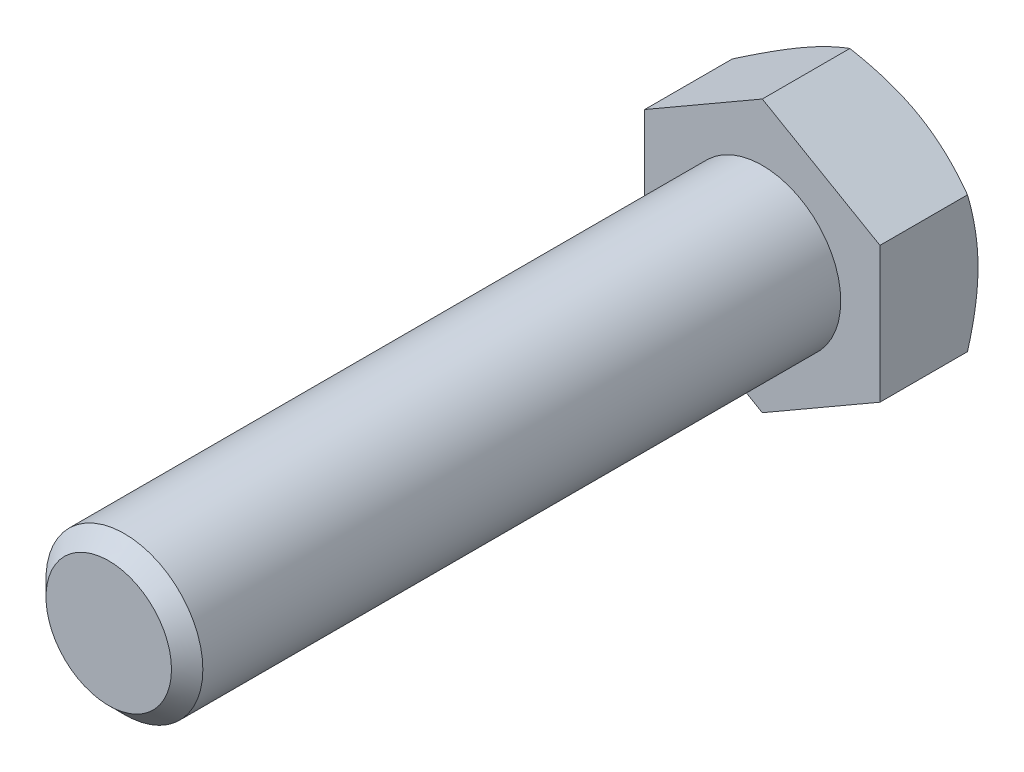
ISO-10303-21;
HEADER;
FILE_DESCRIPTION(('STEP AP214'),'2;1');
FILE_NAME('part.step','',(''),(''),'','','');
FILE_SCHEMA(('AUTOMOTIVE_DESIGN { 1 0 10303 214 1 1 1 1 }'));
ENDSEC;
DATA;
#1=APPLICATION_CONTEXT('core data for automotive mechanical design processes');
#2=APPLICATION_PROTOCOL_DEFINITION('international standard','automotive_design',2000,#1);
#3=PRODUCT_CONTEXT('',#1,'mechanical');
#4=PRODUCT('Part','Part','',(#3));
#5=PRODUCT_RELATED_PRODUCT_CATEGORY('part','',(#4));
#6=PRODUCT_DEFINITION_FORMATION('','',#4);
#7=PRODUCT_DEFINITION_CONTEXT('part definition',#1,'design');
#8=PRODUCT_DEFINITION('design','',#6,#7);
#9=PRODUCT_DEFINITION_SHAPE('','',#8);
#10=(LENGTH_UNIT() NAMED_UNIT(*) SI_UNIT(.MILLI.,.METRE.));
#11=(NAMED_UNIT(*) PLANE_ANGLE_UNIT() SI_UNIT($,.RADIAN.));
#12=(NAMED_UNIT(*) SI_UNIT($,.STERADIAN.) SOLID_ANGLE_UNIT());
#13=UNCERTAINTY_MEASURE_WITH_UNIT(LENGTH_MEASURE(1.E-05),#10,'distance_accuracy_value','');
#14=(GEOMETRIC_REPRESENTATION_CONTEXT(3) GLOBAL_UNCERTAINTY_ASSIGNED_CONTEXT((#13)) GLOBAL_UNIT_ASSIGNED_CONTEXT((#10,
#11,#12)) REPRESENTATION_CONTEXT('',''));
#15=CARTESIAN_POINT('',(0.,0.,0.));
#16=DIRECTION('',(0.,0.,1.));
#17=DIRECTION('',(1.,0.,0.));
#18=AXIS2_PLACEMENT_3D('',#15,#16,#17);
#19=CARTESIAN_POINT('',(-5.55111512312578E-13,-1.66533453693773E-13,50.));
#20=DIRECTION('',(0.,0.,0.999999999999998));
#21=DIRECTION('',(1.,0.,0.));
#22=AXIS2_PLACEMENT_3D('',#19,#20,#21);
#23=PLANE('',#22);
#24=CARTESIAN_POINT('',(-5.55111512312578E-13,-1.66533453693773E-13,50.));
#25=DIRECTION('',(0.,0.,0.999999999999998));
#26=DIRECTION('',(1.,0.,0.));
#27=AXIS2_PLACEMENT_3D('',#24,#25,#26);
#28=CIRCLE('',#27,4.80000000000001);
#29=CARTESIAN_POINT('',(4.79999999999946,-1.62270197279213E-13,50.));
#30=VERTEX_POINT('',#29);
#31=EDGE_CURVE('E204',#30,#30,#28,.T.);
#32=ORIENTED_EDGE('',*,*,#31,.T.);
#33=EDGE_LOOP('',(#32));
#34=FACE_BOUND('',#33,.T.);
#35=ADVANCED_FACE('F30',(#34),#23,.T.);
#36=CARTESIAN_POINT('',(0.,0.,0.));
#37=DIRECTION('',(0.,0.,0.999999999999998));
#38=DIRECTION('',(1.,0.,0.));
#39=AXIS2_PLACEMENT_3D('',#36,#37,#38);
#40=CYLINDRICAL_SURFACE('',#39,6.);
#41=CARTESIAN_POINT('',(-7.7715611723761E-13,-2.77555756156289E-13,48.8000000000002));
#42=DIRECTION('',(0.,0.,0.999999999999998));
#43=DIRECTION('',(1.,0.,0.));
#44=AXIS2_PLACEMENT_3D('',#41,#42,#43);
#45=CIRCLE('',#44,6.);
#46=CARTESIAN_POINT('',(6.00000000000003,0.,48.8000000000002));
#47=VERTEX_POINT('',#46);
#48=EDGE_CURVE('E206',#47,#47,#45,.F.);
#49=CARTESIAN_POINT('',(0.,0.,0.));
#50=DIRECTION('',(0.,0.,0.999999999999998));
#51=DIRECTION('',(1.,0.,0.));
#52=AXIS2_PLACEMENT_3D('',#49,#50,#51);
#53=CIRCLE('',#52,6.);
#54=CARTESIAN_POINT('',(6.00000000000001,0.,0.));
#55=VERTEX_POINT('',#54);
#56=EDGE_CURVE('E207',#55,#55,#53,.F.);
#57=CARTESIAN_POINT('',(6.00000000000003,0.,48.8000000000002));
#58=CARTESIAN_POINT('',(6.00000000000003,0.,48.2916666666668));
#59=CARTESIAN_POINT('',(6.00000000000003,0.,47.7833333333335));
#60=CARTESIAN_POINT('',(6.00000000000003,0.,46.7666666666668));
#61=CARTESIAN_POINT('',(6.00000000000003,0.,46.2583333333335));
#62=CARTESIAN_POINT('',(6.00000000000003,0.,45.2416666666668));
#63=CARTESIAN_POINT('',(6.00000000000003,0.,44.7333333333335));
#64=CARTESIAN_POINT('',(6.00000000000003,0.,43.7166666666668));
#65=CARTESIAN_POINT('',(6.00000000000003,0.,43.2083333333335));
#66=CARTESIAN_POINT('',(6.00000000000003,0.,42.1916666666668));
#67=CARTESIAN_POINT('',(6.00000000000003,0.,41.6833333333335));
#68=CARTESIAN_POINT('',(6.00000000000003,0.,40.6666666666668));
#69=CARTESIAN_POINT('',(6.00000000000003,0.,40.1583333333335));
#70=CARTESIAN_POINT('',(6.00000000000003,0.,39.1416666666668));
#71=CARTESIAN_POINT('',(6.00000000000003,0.,38.6333333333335));
#72=CARTESIAN_POINT('',(6.00000000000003,0.,37.6166666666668));
#73=CARTESIAN_POINT('',(6.00000000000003,0.,37.1083333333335));
#74=CARTESIAN_POINT('',(6.00000000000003,0.,36.0916666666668));
#75=CARTESIAN_POINT('',(6.00000000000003,0.,35.5833333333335));
#76=CARTESIAN_POINT('',(6.00000000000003,0.,34.5666666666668));
#77=CARTESIAN_POINT('',(6.00000000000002,0.,34.0583333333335));
#78=CARTESIAN_POINT('',(6.00000000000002,0.,33.0416666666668));
#79=CARTESIAN_POINT('',(6.00000000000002,0.,32.5333333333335));
#80=CARTESIAN_POINT('',(6.00000000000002,0.,31.5166666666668));
#81=CARTESIAN_POINT('',(6.00000000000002,0.,31.0083333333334));
#82=CARTESIAN_POINT('',(6.00000000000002,0.,29.9916666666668));
#83=CARTESIAN_POINT('',(6.00000000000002,0.,29.4833333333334));
#84=CARTESIAN_POINT('',(6.00000000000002,0.,28.4666666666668));
#85=CARTESIAN_POINT('',(6.00000000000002,0.,27.9583333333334));
#86=CARTESIAN_POINT('',(6.00000000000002,0.,26.9416666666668));
#87=CARTESIAN_POINT('',(6.00000000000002,0.,26.4333333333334));
#88=CARTESIAN_POINT('',(6.00000000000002,0.,25.4166666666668));
#89=CARTESIAN_POINT('',(6.00000000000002,0.,24.9083333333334));
#90=CARTESIAN_POINT('',(6.00000000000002,0.,23.8916666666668));
#91=CARTESIAN_POINT('',(6.00000000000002,0.,23.3833333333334));
#92=CARTESIAN_POINT('',(6.00000000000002,0.,22.3666666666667));
#93=CARTESIAN_POINT('',(6.00000000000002,0.,21.8583333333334));
#94=CARTESIAN_POINT('',(6.00000000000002,0.,20.8416666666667));
#95=CARTESIAN_POINT('',(6.00000000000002,0.,20.3333333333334));
#96=CARTESIAN_POINT('',(6.00000000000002,0.,19.3166666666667));
#97=CARTESIAN_POINT('',(6.00000000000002,0.,18.8083333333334));
#98=CARTESIAN_POINT('',(6.00000000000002,0.,17.7916666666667));
#99=CARTESIAN_POINT('',(6.00000000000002,0.,17.2833333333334));
#100=CARTESIAN_POINT('',(6.00000000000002,0.,16.2666666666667));
#101=CARTESIAN_POINT('',(6.00000000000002,0.,15.7583333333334));
#102=CARTESIAN_POINT('',(6.00000000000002,0.,14.7416666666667));
#103=CARTESIAN_POINT('',(6.00000000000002,0.,14.2333333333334));
#104=CARTESIAN_POINT('',(6.00000000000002,0.,13.2166666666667));
#105=CARTESIAN_POINT('',(6.00000000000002,0.,12.7083333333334));
#106=CARTESIAN_POINT('',(6.00000000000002,0.,11.6916666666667));
#107=CARTESIAN_POINT('',(6.00000000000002,0.,11.1833333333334));
#108=CARTESIAN_POINT('',(6.00000000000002,0.,10.1666666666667));
#109=CARTESIAN_POINT('',(6.00000000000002,0.,9.65833333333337));
#110=CARTESIAN_POINT('',(6.00000000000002,0.,8.6416666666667));
#111=CARTESIAN_POINT('',(6.00000000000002,0.,8.13333333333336));
#112=CARTESIAN_POINT('',(6.00000000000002,0.,7.11666666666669));
#113=CARTESIAN_POINT('',(6.00000000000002,0.,6.60833333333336));
#114=CARTESIAN_POINT('',(6.00000000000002,0.,5.59166666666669));
#115=CARTESIAN_POINT('',(6.00000000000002,0.,5.08333333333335));
#116=CARTESIAN_POINT('',(6.00000000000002,0.,4.06666666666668));
#117=CARTESIAN_POINT('',(6.00000000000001,0.,3.55833333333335));
#118=CARTESIAN_POINT('',(6.00000000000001,0.,2.54166666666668));
#119=CARTESIAN_POINT('',(6.00000000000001,0.,2.03333333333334));
#120=CARTESIAN_POINT('',(6.00000000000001,0.,1.01666666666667));
#121=CARTESIAN_POINT('',(6.00000000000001,0.,0.508333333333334));
#122=CARTESIAN_POINT('',(6.00000000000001,0.,0.));
#123=B_SPLINE_CURVE_WITH_KNOTS('',3,(#57,#58,#59,#60,#61,#62,#63,#64,#65,#66,#67,#68,#69,#70,
#71,#72,#73,#74,#75,#76,#77,#78,#79,#80,#81,#82,#83,#84,#85,#86,#87,#88,#89,#90,#91,#92,#93,#94,
#95,#96,#97,#98,#99,#100,#101,#102,#103,#104,#105,#106,#107,#108,#109,#110,#111,#112,#113,#114,
#115,#116,#117,#118,#119,#120,#121,#122),.UNSPECIFIED.,.F.,.F.,(4,2,2,2,2,2,2,2,2,2,2,2,2,2,2,2,
2,2,2,2,2,2,2,2,2,2,2,2,2,2,2,2,4),(0.,1.52500000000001,3.05000000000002,4.57500000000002,
6.10000000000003,7.62500000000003,9.15000000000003,10.675,12.2,13.725,15.2500000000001,
16.7750000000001,18.3000000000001,19.8250000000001,21.3500000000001,22.8750000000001,
24.4000000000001,25.9250000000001,27.4500000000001,28.9750000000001,30.5000000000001,
32.0250000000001,33.5500000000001,35.0750000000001,36.6000000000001,38.1250000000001,
39.6500000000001,41.1750000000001,42.7000000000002,44.2250000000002,45.7500000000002,
47.2750000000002,48.8000000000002),.UNSPECIFIED.);
#124=EDGE_CURVE('BSEAM195',#47,#55,#123,.T.);
#125=ORIENTED_EDGE('',*,*,#48,.T.);
#126=ORIENTED_EDGE('',*,*,#56,.F.);
#127=ORIENTED_EDGE('',*,*,#124,.T.);
#128=ORIENTED_EDGE('',*,*,#124,.F.);
#129=EDGE_LOOP('',(#125,#127,#126,#128));
#130=FACE_BOUND('',#129,.T.);
#131=ADVANCED_FACE('F195',(#130),#40,.T.);
#132=CARTESIAN_POINT('',(-5.55111512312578E-13,-1.66533453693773E-13,50.));
#133=DIRECTION('',(0.,0.,-0.999999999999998));
#134=DIRECTION('',(-1.,0.,0.));
#135=AXIS2_PLACEMENT_3D('',#132,#133,#134);
#136=CONICAL_SURFACE('',#135,4.80000000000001,0.785398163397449);
#137=ORIENTED_EDGE('',*,*,#48,.F.);
#138=EDGE_LOOP('',(#137));
#139=FACE_BOUND('',#138,.T.);
#140=ORIENTED_EDGE('',*,*,#31,.F.);
#141=EDGE_LOOP('',(#140));
#142=FACE_BOUND('',#141,.T.);
#143=ADVANCED_FACE('F200',(#139,#142),#136,.T.);
#144=CARTESIAN_POINT('',(3.33066907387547E-13,10.3923048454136,-7.49999999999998));
#145=DIRECTION('',(0.5,0.866025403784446,0.));
#146=DIRECTION('',(-0.866025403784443,0.5,0.));
#147=AXIS2_PLACEMENT_3D('',#144,#145,#146);
#148=PLANE('',#147);
#149=CARTESIAN_POINT('',(-0.000200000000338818,10.3924203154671,-6.69608575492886));
#150=CARTESIAN_POINT('',(0.19760704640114,10.2782163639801,-6.76201799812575));
#151=CARTESIAN_POINT('',(0.396185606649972,10.1635669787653,-6.82495859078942));
#152=CARTESIAN_POINT('',(0.794955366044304,9.9333371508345,-6.94403100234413));
#153=CARTESIAN_POINT('',(0.99514722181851,9.81775632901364,-7.00015988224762));
#154=CARTESIAN_POINT('',(1.39751505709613,9.58544915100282,-7.10484803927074));
#155=CARTESIAN_POINT('',(1.59969459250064,9.46872074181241,-7.15338922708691));
#156=CARTESIAN_POINT('',(2.00542875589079,9.23447001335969,-7.24185148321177));
#157=CARTESIAN_POINT('',(2.20898309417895,9.1169478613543,-7.28177431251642));
#158=CARTESIAN_POINT('',(2.61230590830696,8.88408932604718,-7.35131532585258));
#159=CARTESIAN_POINT('',(2.81204459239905,8.76877014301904,-7.3811624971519));
#160=CARTESIAN_POINT('',(3.21241567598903,8.5376157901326,-7.43120669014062));
#161=CARTESIAN_POINT('',(3.41304799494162,8.42178066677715,-7.45140456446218));
#162=CARTESIAN_POINT('',(3.81466063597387,8.18990950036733,-7.48164565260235));
#163=CARTESIAN_POINT('',(4.01564030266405,8.07387383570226,-7.49170039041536));
#164=CARTESIAN_POINT('',(4.41778459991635,7.84169571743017,-7.50143766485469));
#165=CARTESIAN_POINT('',(4.61894922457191,7.72555326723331,-7.50112052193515));
#166=CARTESIAN_POINT('',(4.99503261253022,7.50842142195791,-7.49083604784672));
#167=CARTESIAN_POINT('',(5.16997789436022,7.40741671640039,-7.48212325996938));
#168=CARTESIAN_POINT('',(5.51945867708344,7.20564389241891,-7.45702265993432));
#169=CARTESIAN_POINT('',(5.69399414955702,7.10487579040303,-7.44063433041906));
#170=CARTESIAN_POINT('',(6.2169248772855,6.80296159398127,-7.38034344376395));
#171=CARTESIAN_POINT('',(6.56439451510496,6.60234990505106,-7.32532251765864));
#172=CARTESIAN_POINT('',(7.26301962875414,6.1989985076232,-7.1877695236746));
#173=CARTESIAN_POINT('',(7.61408594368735,5.99631027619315,-7.10465438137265));
#174=CARTESIAN_POINT('',(8.31098330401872,5.59395639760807,-6.91601746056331));
#175=CARTESIAN_POINT('',(8.6568232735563,5.39428559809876,-6.81053998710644));
#176=CARTESIAN_POINT('',(9.00019999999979,5.19603695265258,-6.69608575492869));
#177=B_SPLINE_CURVE_WITH_KNOTS('',3,(#149,#150,#151,#152,#153,#154,#155,#156,#157,#158,#159,
#160,#161,#162,#163,#164,#165,#166,#167,#168,#169,#170,#171,#172,#173,#174,#175,#176),
.UNSPECIFIED.,.F.,.F.,(4,2,2,2,2,2,2,2,2,2,2,2,2,4),(0.,0.713219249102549,1.42674513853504,
2.14194697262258,2.85700253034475,3.55449749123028,4.25193080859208,4.94857085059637,
5.64518936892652,6.25162976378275,6.85811104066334,8.07193747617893,9.31268391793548,
10.5509947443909),.UNSPECIFIED.);
#178=CARTESIAN_POINT('',(4.44089209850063E-13,10.3923048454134,-6.69615242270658));
#179=VERTEX_POINT('',#178);
#180=CARTESIAN_POINT('',(4.50000000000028,7.79422863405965,-7.4999999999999));
#181=VERTEX_POINT('',#180);
#182=EDGE_CURVE('E240',#179,#181,#177,.T.);
#183=ORIENTED_EDGE('',*,*,#182,.F.);
#184=DIRECTION('',(0.,0.,0.999999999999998));
#185=VECTOR('',#184,1.);
#186=CARTESIAN_POINT('',(3.33066907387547E-13,10.3923048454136,-7.49999999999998));
#187=LINE('',#186,#185);
#188=CARTESIAN_POINT('',(0.,10.3923048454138,0.));
#189=VERTEX_POINT('',#188);
#190=EDGE_CURVE('E214',#179,#189,#187,.T.);
#191=ORIENTED_EDGE('',*,*,#190,.T.);
#192=DIRECTION('',(-0.866025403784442,0.5,0.));
#193=VECTOR('',#192,1.);
#194=CARTESIAN_POINT('',(0.,10.3923048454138,0.));
#195=LINE('',#194,#193);
#196=CARTESIAN_POINT('',(8.99999999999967,5.19615242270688,0.));
#197=VERTEX_POINT('',#196);
#198=EDGE_CURVE('E238',#197,#189,#195,.T.);
#199=ORIENTED_EDGE('',*,*,#198,.F.);
#200=DIRECTION('',(0.,0.,0.999999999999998));
#201=VECTOR('',#200,1.);
#202=CARTESIAN_POINT('',(9.00000000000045,5.19615242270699,-7.49999999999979));
#203=LINE('',#202,#201);
#204=CARTESIAN_POINT('',(9.00000000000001,5.1961524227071,-6.69615242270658));
#205=VERTEX_POINT('',#204);
#206=EDGE_CURVE('E211',#205,#197,#203,.T.);
#207=ORIENTED_EDGE('',*,*,#206,.F.);
#208=EDGE_CURVE('E170',#181,#205,#177,.T.);
#209=ORIENTED_EDGE('',*,*,#208,.F.);
#210=EDGE_LOOP('',(#183,#191,#199,#207,#209));
#211=FACE_BOUND('',#210,.T.);
#212=ADVANCED_FACE('F180',(#211),#148,.T.);
#213=CARTESIAN_POINT('',(8.99999999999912,-5.19615242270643,-7.49999999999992));
#214=DIRECTION('',(1.,0.,0.));
#215=DIRECTION('',(0.,0.,-0.999999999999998));
#216=AXIS2_PLACEMENT_3D('',#213,#214,#215);
#217=PLANE('',#216);
#218=CARTESIAN_POINT('',(8.9999999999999,-14.1938054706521,-2.99281770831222));
#219=CARTESIAN_POINT('',(8.9999999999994,-13.7986249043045,-3.18545400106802));
#220=CARTESIAN_POINT('',(8.9999999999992,-13.4025620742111,-3.37631016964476));
#221=CARTESIAN_POINT('',(8.99999999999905,-12.6082034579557,-3.75346543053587));
#222=CARTESIAN_POINT('',(8.99999999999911,-12.2099073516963,-3.93976384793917));
#223=CARTESIAN_POINT('',(8.99999999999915,-11.4086732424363,-4.3076938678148));
#224=CARTESIAN_POINT('',(8.99999999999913,-11.005721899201,-4.48929651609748));
#225=CARTESIAN_POINT('',(8.99999999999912,-10.1966954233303,-4.84537774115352));
#226=CARTESIAN_POINT('',(8.99999999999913,-9.79062043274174,-5.01985663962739));
#227=CARTESIAN_POINT('',(8.99999999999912,-8.96081603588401,-5.36560228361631));
#228=CARTESIAN_POINT('',(8.9999999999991,-8.53695616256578,-5.53655757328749));
#229=CARTESIAN_POINT('',(8.99999999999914,-7.68436682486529,-5.86609252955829));
#230=CARTESIAN_POINT('',(8.9999999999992,-7.25563683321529,-6.02467084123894));
#231=CARTESIAN_POINT('',(8.99999999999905,-6.39334839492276,-6.32546141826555));
#232=CARTESIAN_POINT('',(8.99999999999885,-5.95980093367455,-6.4677048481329));
#233=CARTESIAN_POINT('',(8.99999999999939,-5.08650675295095,-6.7314200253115));
#234=CARTESIAN_POINT('',(9.00000000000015,-4.64676195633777,-6.85289806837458));
#235=CARTESIAN_POINT('',(9.00000000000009,-3.7631885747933,-7.06875933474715));
#236=CARTESIAN_POINT('',(8.9999999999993,-3.31939822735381,-7.16329494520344));
#237=CARTESIAN_POINT('',(8.99999999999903,-2.64948950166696,-7.28091249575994));
#238=CARTESIAN_POINT('',(8.99999999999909,-2.42546830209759,-7.3160888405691));
#239=CARTESIAN_POINT('',(8.99999999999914,-1.97623392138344,-7.37769613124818));
#240=CARTESIAN_POINT('',(8.99999999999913,-1.75102085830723,-7.40412792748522));
#241=CARTESIAN_POINT('',(8.9999999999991,-1.30274989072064,-7.44737513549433));
#242=CARTESIAN_POINT('',(8.99999999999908,-1.07970414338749,-7.46431601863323));
#243=CARTESIAN_POINT('',(8.99999999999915,-0.633095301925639,-7.48874105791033));
#244=CARTESIAN_POINT('',(8.99999999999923,-0.40953221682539,-7.49622537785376));
#245=CARTESIAN_POINT('',(8.999999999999,0.0377121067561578,-7.50155767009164));
#246=CARTESIAN_POINT('',(8.99999999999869,0.261393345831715,-7.4994055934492));
#247=CARTESIAN_POINT('',(8.99999999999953,0.708460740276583,-7.48552018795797));
#248=CARTESIAN_POINT('',(9.00000000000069,0.931846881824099,-7.47378642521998));
#249=CARTESIAN_POINT('',(9.00000000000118,1.46162752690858,-7.43485039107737));
#250=CARTESIAN_POINT('',(8.99999999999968,1.76772399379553,-7.4034965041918));
#251=CARTESIAN_POINT('',(8.99999999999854,2.37778404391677,-7.32445593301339));
#252=CARTESIAN_POINT('',(8.99999999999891,2.68174735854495,-7.27676722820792));
#253=CARTESIAN_POINT('',(8.9999999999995,3.59000335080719,-7.11171638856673));
#254=CARTESIAN_POINT('',(8.99999999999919,4.19036603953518,-6.97239428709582));
#255=CARTESIAN_POINT('',(8.99999999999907,5.08858153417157,-6.72898039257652));
#256=CARTESIAN_POINT('',(8.99999999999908,5.39104017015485,-6.64089135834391));
#257=CARTESIAN_POINT('',(8.99999999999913,5.99302412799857,-6.45511431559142));
#258=CARTESIAN_POINT('',(8.99999999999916,6.29254942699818,-6.35742623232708));
#259=CARTESIAN_POINT('',(8.99999999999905,6.88875586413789,-6.15405553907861));
#260=CARTESIAN_POINT('',(8.99999999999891,7.18543776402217,-6.04837514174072));
#261=CARTESIAN_POINT('',(8.99999999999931,7.77631041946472,-5.83030807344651));
#262=CARTESIAN_POINT('',(8.99999999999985,8.07050123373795,-5.71792156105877));
#263=CARTESIAN_POINT('',(9.00000000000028,8.86768097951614,-5.40462740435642));
#264=CARTESIAN_POINT('',(8.99999999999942,9.36851420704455,-5.19823951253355));
#265=CARTESIAN_POINT('',(8.99999999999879,10.3649647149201,-4.77318997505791));
#266=CARTESIAN_POINT('',(8.99999999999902,10.8605813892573,-4.55452692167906));
#267=CARTESIAN_POINT('',(8.99999999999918,11.8478077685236,-4.10785524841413));
#268=CARTESIAN_POINT('',(8.99999999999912,12.3394158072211,-3.8798429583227));
#269=CARTESIAN_POINT('',(8.99999999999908,13.3192435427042,-3.41672758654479));
#270=CARTESIAN_POINT('',(8.99999999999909,13.8074633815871,-3.18162480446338));
#271=CARTESIAN_POINT('',(8.9999999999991,14.7819931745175,-2.70549247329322));
#272=CARTESIAN_POINT('',(8.9999999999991,15.2682986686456,-2.46445381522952));
#273=CARTESIAN_POINT('',(8.99999999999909,16.2387067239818,-1.97797920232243));
#274=CARTESIAN_POINT('',(8.99999999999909,16.7228092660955,-1.73254320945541));
#275=CARTESIAN_POINT('',(8.99999999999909,17.6890969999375,-1.23819989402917));
#276=CARTESIAN_POINT('',(8.99999999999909,18.1712826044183,-0.989293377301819));
#277=CARTESIAN_POINT('',(8.99999999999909,19.1341609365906,-0.488607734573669));
#278=CARTESIAN_POINT('',(8.99999999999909,19.6148536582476,-0.236828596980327));
#279=CARTESIAN_POINT('',(8.99999999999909,20.952215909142,0.467839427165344));
#280=CARTESIAN_POINT('',(8.99999999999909,21.8075292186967,0.923301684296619));
#281=CARTESIAN_POINT('',(8.99999999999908,23.5152984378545,1.83966951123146));
#282=CARTESIAN_POINT('',(8.99999999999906,24.3677541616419,2.30057542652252));
#283=CARTESIAN_POINT('',(8.9999999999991,26.0675482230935,3.22485857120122));
#284=CARTESIAN_POINT('',(8.99999999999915,26.9148940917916,3.68822195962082));
#285=CARTESIAN_POINT('',(8.99999999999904,28.1846057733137,4.38556367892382));
#286=CARTESIAN_POINT('',(8.99999999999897,28.6076082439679,4.61838432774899));
#287=CARTESIAN_POINT('',(8.99999999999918,29.4532343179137,5.08471147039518));
#288=CARTESIAN_POINT('',(8.99999999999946,29.8758579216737,5.31821796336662));
#289=CARTESIAN_POINT('',(9.00000000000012,30.2983153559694,5.55202477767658));
#290=B_SPLINE_CURVE_WITH_KNOTS('',3,(#218,#219,#220,#221,#222,#223,#224,#225,#226,#227,#228,
#229,#230,#231,#232,#233,#234,#235,#236,#237,#238,#239,#240,#241,#242,#243,#244,#245,#246,#247,
#248,#249,#250,#251,#252,#253,#254,#255,#256,#257,#258,#259,#260,#261,#262,#263,#264,#265,#266,
#267,#268,#269,#270,#271,#272,#273,#274,#275,#276,#277,#278,#279,#280,#281,#282,#283,#284,#285,
#286,#287,#288,#289),.UNSPECIFIED.,.F.,.F.,(4,2,2,2,2,2,2,2,2,2,2,2,2,2,2,2,2,2,2,2,2,2,2,2,2,2,
2,2,2,2,2,2,2,2,2,4),(0.,1.31891143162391,2.63801699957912,3.96391175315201,5.28974656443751,
6.66070766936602,8.03181864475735,9.4002686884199,10.7683030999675,12.1284389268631,
12.808593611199,13.4886821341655,14.1595537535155,14.8304137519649,15.5012771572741,
16.1721709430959,17.0947490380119,18.0174412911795,19.8637129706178,20.8087031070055,
21.7537006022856,22.6984374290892,23.6431519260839,25.2679809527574,26.8929966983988,
28.5186565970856,30.1442479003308,31.772511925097,33.4007900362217,35.0286961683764,
36.6566088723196,39.5636489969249,42.4708746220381,45.3681585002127,46.8166845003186,
48.2652087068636),.UNSPECIFIED.);
#291=CARTESIAN_POINT('',(8.99999999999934,0.,-7.49999999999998));
#292=VERTEX_POINT('',#291);
#293=EDGE_CURVE('E168',#205,#292,#290,.F.);
#294=ORIENTED_EDGE('',*,*,#293,.F.);
#295=ORIENTED_EDGE('',*,*,#206,.T.);
#296=DIRECTION('',(0.,1.,0.));
#297=VECTOR('',#296,1.);
#298=CARTESIAN_POINT('',(8.99999999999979,-5.19615242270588,0.));
#299=LINE('',#298,#297);
#300=CARTESIAN_POINT('',(8.99999999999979,-5.19615242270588,0.));
#301=VERTEX_POINT('',#300);
#302=EDGE_CURVE('E216',#301,#197,#299,.T.);
#303=ORIENTED_EDGE('',*,*,#302,.F.);
#304=DIRECTION('',(0.,0.,0.999999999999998));
#305=VECTOR('',#304,1.);
#306=CARTESIAN_POINT('',(8.99999999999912,-5.19615242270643,-7.49999999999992));
#307=LINE('',#306,#305);
#308=CARTESIAN_POINT('',(8.9999999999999,-5.19615242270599,-6.69615242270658));
#309=VERTEX_POINT('',#308);
#310=EDGE_CURVE('E222',#309,#301,#307,.T.);
#311=ORIENTED_EDGE('',*,*,#310,.F.);
#312=EDGE_CURVE('E163',#292,#309,#290,.F.);
#313=ORIENTED_EDGE('',*,*,#312,.F.);
#314=EDGE_LOOP('',(#294,#295,#303,#311,#313));
#315=FACE_BOUND('',#314,.T.);
#316=ADVANCED_FACE('F176',(#315),#217,.T.);
#317=CARTESIAN_POINT('',(-4.44089209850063E-13,-10.3923048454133,-7.49999999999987));
#318=DIRECTION('',(0.499999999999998,-0.866025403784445,0.));
#319=DIRECTION('',(0.866025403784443,0.500000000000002,0.));
#320=AXIS2_PLACEMENT_3D('',#317,#318,#319);
#321=PLANE('',#320);
#322=CARTESIAN_POINT('',(9.0001999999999,-5.19603695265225,-6.69608575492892));
#323=CARTESIAN_POINT('',(8.80239295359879,-5.31024090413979,-6.762017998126));
#324=CARTESIAN_POINT('',(8.60381439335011,-5.42489028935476,-6.82495859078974));
#325=CARTESIAN_POINT('',(8.20504463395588,-5.65512011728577,-6.94403100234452));
#326=CARTESIAN_POINT('',(8.00485277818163,-5.77070093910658,-7.000159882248));
#327=CARTESIAN_POINT('',(7.60248494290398,-6.00300811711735,-7.1048480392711));
#328=CARTESIAN_POINT('',(7.40030540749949,-6.11973652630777,-7.15338922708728));
#329=CARTESIAN_POINT('',(6.99457124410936,-6.3539872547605,-7.24185148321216));
#330=CARTESIAN_POINT('',(6.7910169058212,-6.47150940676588,-7.2817743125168));
#331=CARTESIAN_POINT('',(6.3876940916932,-6.70436794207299,-7.35131532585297));
#332=CARTESIAN_POINT('',(6.18795540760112,-6.81968712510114,-7.3811624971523));
#333=CARTESIAN_POINT('',(5.78758432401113,-7.05084147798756,-7.43120669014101));
#334=CARTESIAN_POINT('',(5.58695200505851,-7.16667660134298,-7.45140456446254));
#335=CARTESIAN_POINT('',(5.1853393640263,-7.39854776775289,-7.48164565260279));
#336=CARTESIAN_POINT('',(4.98435969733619,-7.51458343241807,-7.49170039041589));
#337=CARTESIAN_POINT('',(4.58221540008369,-7.74676155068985,-7.50143766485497));
#338=CARTESIAN_POINT('',(4.38105077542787,-7.86290400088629,-7.5011205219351));
#339=CARTESIAN_POINT('',(4.00496738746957,-8.08003584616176,-7.49083604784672));
#340=CARTESIAN_POINT('',(3.83002210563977,-8.18104055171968,-7.48212325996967));
#341=CARTESIAN_POINT('',(3.48054132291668,-8.38281337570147,-7.45702265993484));
#342=CARTESIAN_POINT('',(3.30600585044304,-8.48358147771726,-7.4406343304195));
#343=CARTESIAN_POINT('',(2.78307512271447,-8.78549567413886,-7.38034344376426));
#344=CARTESIAN_POINT('',(2.43560548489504,-8.98610736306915,-7.32532251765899));
#345=CARTESIAN_POINT('',(1.7369803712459,-9.38945876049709,-7.18776952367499));
#346=CARTESIAN_POINT('',(1.3859140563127,-9.59214699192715,-7.10465438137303));
#347=CARTESIAN_POINT('',(0.689016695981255,-9.99450087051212,-6.91601746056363));
#348=CARTESIAN_POINT('',(0.343176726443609,-10.1941716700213,-6.81053998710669));
#349=CARTESIAN_POINT('',(-0.000200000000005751,-10.3924203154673,-6.69608575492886));
#350=B_SPLINE_CURVE_WITH_KNOTS('',3,(#322,#323,#324,#325,#326,#327,#328,#329,#330,#331,#332,
#333,#334,#335,#336,#337,#338,#339,#340,#341,#342,#343,#344,#345,#346,#347,#348,#349),
.UNSPECIFIED.,.F.,.F.,(4,2,2,2,2,2,2,2,2,2,2,2,2,4),(0.,0.71321924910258,1.42674513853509,
2.14194697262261,2.85700253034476,3.55449749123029,4.25193080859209,4.9485708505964,
5.64518936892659,6.25162976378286,6.85811104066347,8.07193747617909,9.31268391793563,
10.5509947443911),.UNSPECIFIED.);
#351=CARTESIAN_POINT('',(4.49999999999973,-7.79422863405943,-7.49999999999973));
#352=VERTEX_POINT('',#351);
#353=EDGE_CURVE('E169',#309,#352,#350,.T.);
#354=ORIENTED_EDGE('',*,*,#353,.F.);
#355=ORIENTED_EDGE('',*,*,#310,.T.);
#356=DIRECTION('',(0.866025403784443,0.500000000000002,0.));
#357=VECTOR('',#356,1.);
#358=CARTESIAN_POINT('',(-1.11022302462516E-13,-10.3923048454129,0.));
#359=LINE('',#358,#357);
#360=CARTESIAN_POINT('',(-1.11022302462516E-13,-10.3923048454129,0.));
#361=VERTEX_POINT('',#360);
#362=EDGE_CURVE('E227',#361,#301,#359,.T.);
#363=ORIENTED_EDGE('',*,*,#362,.F.);
#364=DIRECTION('',(0.,0.,0.999999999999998));
#365=VECTOR('',#364,1.);
#366=CARTESIAN_POINT('',(-4.44089209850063E-13,-10.3923048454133,-7.49999999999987));
#367=LINE('',#366,#365);
#368=CARTESIAN_POINT('',(-4.44089209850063E-13,-10.392304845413,-6.69615242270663));
#369=VERTEX_POINT('',#368);
#370=EDGE_CURVE('E220',#369,#361,#367,.T.);
#371=ORIENTED_EDGE('',*,*,#370,.F.);
#372=EDGE_CURVE('E157',#352,#369,#350,.T.);
#373=ORIENTED_EDGE('',*,*,#372,.F.);
#374=EDGE_LOOP('',(#354,#355,#363,#371,#373));
#375=FACE_BOUND('',#374,.T.);
#376=ADVANCED_FACE('F179',(#375),#321,.T.);
#377=CARTESIAN_POINT('',(-4.44089209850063E-13,-10.3923048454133,-7.49999999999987));
#378=DIRECTION('',(-0.500000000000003,-0.866025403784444,0.));
#379=DIRECTION('',(0.86602540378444,-0.500000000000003,0.));
#380=AXIS2_PLACEMENT_3D('',#377,#378,#379);
#381=PLANE('',#380);
#382=CARTESIAN_POINT('',(0.000199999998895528,-10.3924203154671,-6.6960857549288));
#383=CARTESIAN_POINT('',(-0.197607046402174,-10.2782163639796,-6.76201799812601));
#384=CARTESIAN_POINT('',(-0.396185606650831,-10.1635669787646,-6.82495859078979));
#385=CARTESIAN_POINT('',(-0.794955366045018,-9.93333715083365,-6.94403100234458));
#386=CARTESIAN_POINT('',(-0.995147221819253,-9.81775632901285,-7.00015988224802));
#387=CARTESIAN_POINT('',(-1.39751505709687,-9.58544915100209,-7.10484803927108));
#388=CARTESIAN_POINT('',(-1.59969459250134,-9.46872074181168,-7.15338922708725));
#389=CARTESIAN_POINT('',(-2.00542875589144,-9.23447001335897,-7.24185148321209));
#390=CARTESIAN_POINT('',(-2.20898309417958,-9.1169478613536,-7.28177431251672));
#391=CARTESIAN_POINT('',(-2.61230590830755,-8.8840893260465,-7.35131532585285));
#392=CARTESIAN_POINT('',(-2.81204459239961,-8.76877014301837,-7.38116249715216));
#393=CARTESIAN_POINT('',(-3.21241567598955,-8.53761579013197,-7.43120669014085));
#394=CARTESIAN_POINT('',(-3.41304799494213,-8.42178066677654,-7.45140456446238));
#395=CARTESIAN_POINT('',(-3.81466063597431,-8.1899095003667,-7.48164565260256));
#396=CARTESIAN_POINT('',(-4.01564030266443,-8.07387383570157,-7.49170039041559));
#397=CARTESIAN_POINT('',(-4.41778459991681,-7.84169571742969,-7.50143766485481));
#398=CARTESIAN_POINT('',(-4.61894922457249,-7.7255532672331,-7.50112052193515));
#399=CARTESIAN_POINT('',(-4.99503261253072,-7.5084214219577,-7.49083604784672));
#400=CARTESIAN_POINT('',(-5.16997789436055,-7.40741671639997,-7.48212325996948));
#401=CARTESIAN_POINT('',(-5.51945867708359,-7.20564389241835,-7.4570226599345));
#402=CARTESIAN_POINT('',(-5.69399414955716,-7.10487579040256,-7.44063433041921));
#403=CARTESIAN_POINT('',(-6.21692487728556,-6.80296159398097,-7.38034344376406));
#404=CARTESIAN_POINT('',(-6.56439451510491,-6.60234990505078,-7.32532251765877));
#405=CARTESIAN_POINT('',(-7.26301962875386,-6.19899850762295,-7.18776952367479));
#406=CARTESIAN_POINT('',(-7.61408594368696,-5.99631027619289,-7.10465438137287));
#407=CARTESIAN_POINT('',(-8.31098330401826,-5.5939563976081,-6.91601746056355));
#408=CARTESIAN_POINT('',(-8.65682327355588,-5.39428559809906,-6.81053998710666));
#409=CARTESIAN_POINT('',(-9.00019999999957,-5.19603695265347,-6.69608575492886));
#410=B_SPLINE_CURVE_WITH_KNOTS('',3,(#382,#383,#384,#385,#386,#387,#388,#389,#390,#391,#392,
#393,#394,#395,#396,#397,#398,#399,#400,#401,#402,#403,#404,#405,#406,#407,#408,#409),
.UNSPECIFIED.,.F.,.F.,(4,2,2,2,2,2,2,2,2,2,2,2,2,4),(0.,0.713219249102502,1.42674513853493,
2.14194697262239,2.85700253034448,3.55449749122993,4.25193080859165,4.94857085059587,
5.64518936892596,6.25162976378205,6.85811104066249,8.07193747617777,9.312683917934,
10.5509947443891),.UNSPECIFIED.);
#411=CARTESIAN_POINT('',(-4.50000000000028,-7.79422863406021,-7.49999999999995));
#412=VERTEX_POINT('',#411);
#413=EDGE_CURVE('E259',#369,#412,#410,.T.);
#414=ORIENTED_EDGE('',*,*,#413,.F.);
#415=ORIENTED_EDGE('',*,*,#370,.T.);
#416=DIRECTION('',(0.866025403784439,-0.500000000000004,0.));
#417=VECTOR('',#416,1.);
#418=CARTESIAN_POINT('',(-1.11022302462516E-13,-10.3923048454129,0.));
#419=LINE('',#418,#417);
#420=CARTESIAN_POINT('',(-9.00000000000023,-5.19615242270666,0.));
#421=VERTEX_POINT('',#420);
#422=EDGE_CURVE('E230',#421,#361,#419,.T.);
#423=ORIENTED_EDGE('',*,*,#422,.F.);
#424=DIRECTION('',(0.,0.,0.999999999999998));
#425=VECTOR('',#424,1.);
#426=CARTESIAN_POINT('',(-9.00000000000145,-5.19615242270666,-7.49999999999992));
#427=LINE('',#426,#425);
#428=CARTESIAN_POINT('',(-9.00000000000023,-5.19615242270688,-6.69615242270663));
#429=VERTEX_POINT('',#428);
#430=EDGE_CURVE('E218',#429,#421,#427,.T.);
#431=ORIENTED_EDGE('',*,*,#430,.F.);
#432=EDGE_CURVE('E106',#412,#429,#410,.T.);
#433=ORIENTED_EDGE('',*,*,#432,.F.);
#434=EDGE_LOOP('',(#414,#415,#423,#431,#433));
#435=FACE_BOUND('',#434,.T.);
#436=ADVANCED_FACE('F184',(#435),#381,.T.);
#437=CARTESIAN_POINT('',(-9.00000000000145,-5.19615242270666,-7.49999999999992));
#438=DIRECTION('',(-1.,0.,0.));
#439=DIRECTION('',(0.,0.,0.999999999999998));
#440=AXIS2_PLACEMENT_3D('',#437,#438,#439);
#441=PLANE('',#440);
#442=CARTESIAN_POINT('',(-8.99999999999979,-14.1938054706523,-2.992817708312));
#443=CARTESIAN_POINT('',(-9.00000000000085,-13.7986249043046,-3.18545400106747));
#444=CARTESIAN_POINT('',(-9.00000000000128,-13.4025620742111,-3.37631016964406));
#445=CARTESIAN_POINT('',(-9.0000000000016,-12.6082034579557,-3.75346543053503));
#446=CARTESIAN_POINT('',(-9.00000000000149,-12.2099073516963,-3.93976384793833));
#447=CARTESIAN_POINT('',(-9.0000000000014,-11.4086732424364,-4.30769386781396));
#448=CARTESIAN_POINT('',(-9.00000000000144,-11.005721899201,-4.48929651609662));
#449=CARTESIAN_POINT('',(-9.00000000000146,-10.1966954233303,-4.84537774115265));
#450=CARTESIAN_POINT('',(-9.00000000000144,-9.79062043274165,-5.01985663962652));
#451=CARTESIAN_POINT('',(-9.00000000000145,-8.96081603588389,-5.3656022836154));
#452=CARTESIAN_POINT('',(-9.00000000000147,-8.53695616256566,-5.53655757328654));
#453=CARTESIAN_POINT('',(-9.00000000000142,-7.68436682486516,-5.86609252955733));
#454=CARTESIAN_POINT('',(-9.00000000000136,-7.25563683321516,-6.02467084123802));
#455=CARTESIAN_POINT('',(-9.00000000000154,-6.3933483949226,-6.32546141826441));
#456=CARTESIAN_POINT('',(-9.00000000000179,-5.95980093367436,-6.4677048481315));
#457=CARTESIAN_POINT('',(-9.00000000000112,-5.086506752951,-6.73142002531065));
#458=CARTESIAN_POINT('',(-9.0000000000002,-4.64676195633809,-6.85289806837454));
#459=CARTESIAN_POINT('',(-9.00000000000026,-3.76318857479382,-7.06875933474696));
#460=CARTESIAN_POINT('',(-9.00000000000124,-3.31939822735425,-7.16329494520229));
#461=CARTESIAN_POINT('',(-9.00000000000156,-2.64948950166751,-7.28091249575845));
#462=CARTESIAN_POINT('',(-9.00000000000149,-2.4254683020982,-7.31608884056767));
#463=CARTESIAN_POINT('',(-9.00000000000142,-1.97623392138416,-7.3776961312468));
#464=CARTESIAN_POINT('',(-9.00000000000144,-1.751020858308,-7.40412792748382));
#465=CARTESIAN_POINT('',(-9.00000000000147,-1.3027498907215,-7.44737513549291));
#466=CARTESIAN_POINT('',(-9.00000000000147,-1.07970414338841,-7.4643160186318));
#467=CARTESIAN_POINT('',(-9.00000000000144,-0.633095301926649,-7.48874105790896));
#468=CARTESIAN_POINT('',(-9.0000000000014,-0.409532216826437,-7.49622537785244));
#469=CARTESIAN_POINT('',(-9.00000000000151,0.0377121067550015,-7.50155767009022));
#470=CARTESIAN_POINT('',(-9.00000000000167,0.261393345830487,-7.49940559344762));
#471=CARTESIAN_POINT('',(-9.00000000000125,0.708460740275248,-7.48552018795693));
#472=CARTESIAN_POINT('',(-9.00000000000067,0.93184688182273,-7.47378642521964));
#473=CARTESIAN_POINT('',(-9.00000000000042,1.46162752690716,-7.43485039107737));
#474=CARTESIAN_POINT('',(-9.00000000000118,1.76772399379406,-7.40349650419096));
#475=CARTESIAN_POINT('',(-9.00000000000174,2.37778404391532,-7.32445593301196));
#476=CARTESIAN_POINT('',(-9.00000000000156,2.68174735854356,-7.27676722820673));
#477=CARTESIAN_POINT('',(-9.00000000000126,3.59000335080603,-7.11171638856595));
#478=CARTESIAN_POINT('',(-9.00000000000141,4.19036603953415,-6.97239428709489));
#479=CARTESIAN_POINT('',(-9.00000000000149,5.08858153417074,-6.72898039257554));
#480=CARTESIAN_POINT('',(-9.0000000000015,5.39104017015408,-6.64089135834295));
#481=CARTESIAN_POINT('',(-9.00000000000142,5.99302412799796,-6.4551143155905));
#482=CARTESIAN_POINT('',(-9.00000000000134,6.29254942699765,-6.3574262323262));
#483=CARTESIAN_POINT('',(-9.00000000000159,6.88875586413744,-6.15405553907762));
#484=CARTESIAN_POINT('',(-9.00000000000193,7.18543776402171,-6.04837514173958));
#485=CARTESIAN_POINT('',(-9.000000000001,7.77631041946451,-5.83030807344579));
#486=CARTESIAN_POINT('',(-8.99999999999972,8.07050123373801,-5.71792156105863));
#487=CARTESIAN_POINT('',(-8.9999999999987,8.86768097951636,-5.40462740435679));
#488=CARTESIAN_POINT('',(-9.00000000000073,9.36851420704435,-5.19823951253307));
#489=CARTESIAN_POINT('',(-9.00000000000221,10.3649647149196,-4.77318997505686));
#490=CARTESIAN_POINT('',(-9.00000000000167,10.8605813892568,-4.5545269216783));
#491=CARTESIAN_POINT('',(-9.00000000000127,11.8478077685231,-4.10785524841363));
#492=CARTESIAN_POINT('',(-9.00000000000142,12.3394158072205,-3.87984295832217));
#493=CARTESIAN_POINT('',(-9.00000000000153,13.3192435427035,-3.41672758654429));
#494=CARTESIAN_POINT('',(-9.00000000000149,13.8074633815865,-3.18162480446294));
#495=CARTESIAN_POINT('',(-9.00000000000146,14.7819931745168,-2.70549247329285));
#496=CARTESIAN_POINT('',(-9.00000000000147,15.2682986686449,-2.46445381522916));
#497=CARTESIAN_POINT('',(-9.00000000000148,16.238706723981,-1.97797920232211));
#498=CARTESIAN_POINT('',(-9.00000000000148,16.7228092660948,-1.73254320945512));
#499=CARTESIAN_POINT('',(-9.00000000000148,17.6890969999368,-1.23819989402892));
#500=CARTESIAN_POINT('',(-9.00000000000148,18.1712826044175,-0.989293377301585));
#501=CARTESIAN_POINT('',(-9.00000000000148,19.1341609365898,-0.488607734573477));
#502=CARTESIAN_POINT('',(-9.00000000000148,19.6148536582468,-0.236828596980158));
#503=CARTESIAN_POINT('',(-9.00000000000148,20.9522159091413,0.467839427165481));
#504=CARTESIAN_POINT('',(-9.00000000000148,21.807529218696,0.923301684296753));
#505=CARTESIAN_POINT('',(-9.00000000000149,23.5152984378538,1.8396695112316));
#506=CARTESIAN_POINT('',(-9.00000000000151,24.3677541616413,2.30057542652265));
#507=CARTESIAN_POINT('',(-9.00000000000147,26.0675482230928,3.22485857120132));
#508=CARTESIAN_POINT('',(-9.00000000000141,26.9148940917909,3.68822195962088));
#509=CARTESIAN_POINT('',(-9.00000000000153,28.184605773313,4.38556367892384));
#510=CARTESIAN_POINT('',(-9.00000000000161,28.6076082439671,4.618384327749));
#511=CARTESIAN_POINT('',(-9.00000000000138,29.4532343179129,5.08471147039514));
#512=CARTESIAN_POINT('',(-9.00000000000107,29.8758579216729,5.31821796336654));
#513=CARTESIAN_POINT('',(-9.00000000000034,30.2983153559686,5.55202477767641));
#514=B_SPLINE_CURVE_WITH_KNOTS('',3,(#442,#443,#444,#445,#446,#447,#448,#449,#450,#451,#452,
#453,#454,#455,#456,#457,#458,#459,#460,#461,#462,#463,#464,#465,#466,#467,#468,#469,#470,#471,
#472,#473,#474,#475,#476,#477,#478,#479,#480,#481,#482,#483,#484,#485,#486,#487,#488,#489,#490,
#491,#492,#493,#494,#495,#496,#497,#498,#499,#500,#501,#502,#503,#504,#505,#506,#507,#508,#509,
#510,#511,#512,#513),.UNSPECIFIED.,.F.,.F.,(4,2,2,2,2,2,2,2,2,2,2,2,2,2,2,2,2,2,2,2,2,2,2,2,2,2,
2,2,2,2,2,2,2,2,2,4),(0.,1.3189114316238,2.63801699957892,3.96391175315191,5.28974656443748,
6.66070766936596,8.03181864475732,9.40026868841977,10.7683030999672,12.1284389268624,
12.8085936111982,13.4886821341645,14.1595537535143,14.8304137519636,15.5012771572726,
16.1721709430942,17.0947490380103,18.017441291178,19.8637129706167,20.8087031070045,
21.7537006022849,22.6984374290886,23.6431519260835,25.2679809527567,26.892996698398,
28.5186565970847,30.1442479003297,31.7725119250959,33.4007900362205,35.0286961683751,
36.6566088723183,39.5636489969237,42.470874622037,45.3681585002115,46.8166845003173,
48.2652087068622),.UNSPECIFIED.);
#515=CARTESIAN_POINT('',(-9.00000000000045,0.,-7.49999999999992));
#516=VERTEX_POINT('',#515);
#517=EDGE_CURVE('E101',#429,#516,#514,.T.);
#518=ORIENTED_EDGE('',*,*,#517,.F.);
#519=ORIENTED_EDGE('',*,*,#430,.T.);
#520=DIRECTION('',(0.,-1.,0.));
#521=VECTOR('',#520,1.);
#522=CARTESIAN_POINT('',(-9.00000000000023,-5.19615242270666,0.));
#523=LINE('',#522,#521);
#524=CARTESIAN_POINT('',(-9.0000000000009,5.19615242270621,0.));
#525=VERTEX_POINT('',#524);
#526=EDGE_CURVE('E233',#525,#421,#523,.T.);
#527=ORIENTED_EDGE('',*,*,#526,.F.);
#528=DIRECTION('',(0.,0.,0.999999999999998));
#529=VECTOR('',#528,1.);
#530=CARTESIAN_POINT('',(-9.00000000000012,5.19615242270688,-7.49999999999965));
#531=LINE('',#530,#529);
#532=CARTESIAN_POINT('',(-8.99999999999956,5.19615242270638,-6.69615242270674));
#533=VERTEX_POINT('',#532);
#534=EDGE_CURVE('E127',#533,#525,#531,.T.);
#535=ORIENTED_EDGE('',*,*,#534,.F.);
#536=EDGE_CURVE('E110',#516,#533,#514,.T.);
#537=ORIENTED_EDGE('',*,*,#536,.F.);
#538=EDGE_LOOP('',(#518,#519,#527,#535,#537));
#539=FACE_BOUND('',#538,.T.);
#540=ADVANCED_FACE('F125',(#539),#441,.T.);
#541=CARTESIAN_POINT('',(-9.00000000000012,5.19615242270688,-7.49999999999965));
#542=DIRECTION('',(-0.500000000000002,0.866025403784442,0.));
#543=DIRECTION('',(-0.866025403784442,-0.500000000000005,0.));
#544=AXIS2_PLACEMENT_3D('',#541,#542,#543);
#545=PLANE('',#544);
#546=CARTESIAN_POINT('',(-9.00019999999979,5.19603695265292,-6.6960857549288));
#547=CARTESIAN_POINT('',(-8.80239295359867,5.31024090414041,-6.76201799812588));
#548=CARTESIAN_POINT('',(-8.60381439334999,5.42489028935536,-6.82495859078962));
#549=CARTESIAN_POINT('',(-8.20504463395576,5.65512011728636,-6.94403100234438));
#550=CARTESIAN_POINT('',(-8.00485277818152,5.77070093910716,-7.00015988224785));
#551=CARTESIAN_POINT('',(-7.60248494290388,6.00300811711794,-7.10484803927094));
#552=CARTESIAN_POINT('',(-7.40030540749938,6.11973652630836,-7.15338922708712));
#553=CARTESIAN_POINT('',(-6.99457124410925,6.35398725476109,-7.24185148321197));
#554=CARTESIAN_POINT('',(-6.79101690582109,6.47150940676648,-7.28177431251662));
#555=CARTESIAN_POINT('',(-6.38769409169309,6.70436794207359,-7.35131532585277));
#556=CARTESIAN_POINT('',(-6.18795540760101,6.81968712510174,-7.38116249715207));
#557=CARTESIAN_POINT('',(-5.78758432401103,7.05084147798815,-7.43120669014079));
#558=CARTESIAN_POINT('',(-5.58695200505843,7.16667660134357,-7.45140456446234));
#559=CARTESIAN_POINT('',(-5.18533936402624,7.39854776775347,-7.4816456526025));
#560=CARTESIAN_POINT('',(-4.98435969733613,7.51458343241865,-7.49170039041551));
#561=CARTESIAN_POINT('',(-4.58221540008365,7.74676155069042,-7.50143766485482));
#562=CARTESIAN_POINT('',(-4.38105077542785,7.86290400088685,-7.50112052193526));
#563=CARTESIAN_POINT('',(-4.00496738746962,8.08003584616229,-7.49083604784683));
#564=CARTESIAN_POINT('',(-3.83002210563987,8.18104055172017,-7.4821232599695));
#565=CARTESIAN_POINT('',(-3.48054132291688,8.38281337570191,-7.45702265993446));
#566=CARTESIAN_POINT('',(-3.30600585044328,8.48358147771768,-7.44063433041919));
#567=CARTESIAN_POINT('',(-2.78307512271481,8.78549567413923,-7.38034344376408));
#568=CARTESIAN_POINT('',(-2.43560548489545,8.98610736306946,-7.32532251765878));
#569=CARTESIAN_POINT('',(-1.73698037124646,9.38945876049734,-7.18776952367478));
#570=CARTESIAN_POINT('',(-1.38591405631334,9.5921469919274,-7.10465438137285));
#571=CARTESIAN_POINT('',(-0.689016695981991,9.99450087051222,-6.91601746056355));
#572=CARTESIAN_POINT('',(-0.343176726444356,10.1941716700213,-6.81053998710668));
#573=CARTESIAN_POINT('',(0.000199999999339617,10.3924203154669,-6.69608575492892));
#574=B_SPLINE_CURVE_WITH_KNOTS('',3,(#546,#547,#548,#549,#550,#551,#552,#553,#554,#555,#556,
#557,#558,#559,#560,#561,#562,#563,#564,#565,#566,#567,#568,#569,#570,#571,#572,#573),
.UNSPECIFIED.,.F.,.F.,(4,2,2,2,2,2,2,2,2,2,2,2,2,4),(0.,0.713219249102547,1.42674513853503,
2.14194697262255,2.85700253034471,3.55449749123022,4.251930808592,4.94857085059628,
5.64518936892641,6.25162976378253,6.858111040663,8.07193747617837,9.31268391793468,
10.5509947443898),.UNSPECIFIED.);
#575=CARTESIAN_POINT('',(-4.49999999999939,7.7942286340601,-7.49999999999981));
#576=VERTEX_POINT('',#575);
#577=EDGE_CURVE('E116',#533,#576,#574,.T.);
#578=ORIENTED_EDGE('',*,*,#577,.F.);
#579=ORIENTED_EDGE('',*,*,#534,.T.);
#580=DIRECTION('',(-0.86602540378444,-0.500000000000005,0.));
#581=VECTOR('',#580,1.);
#582=CARTESIAN_POINT('',(-9.0000000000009,5.19615242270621,0.));
#583=LINE('',#582,#581);
#584=EDGE_CURVE('E236',#189,#525,#583,.T.);
#585=ORIENTED_EDGE('',*,*,#584,.F.);
#586=ORIENTED_EDGE('',*,*,#190,.F.);
#587=EDGE_CURVE('E118',#576,#179,#574,.T.);
#588=ORIENTED_EDGE('',*,*,#587,.F.);
#589=EDGE_LOOP('',(#578,#579,#585,#586,#588));
#590=FACE_BOUND('',#589,.T.);
#591=ADVANCED_FACE('F192',(#590),#545,.T.);
#592=CARTESIAN_POINT('',(8.99999999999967,5.19615242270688,0.));
#593=DIRECTION('',(0.,0.,0.999999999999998));
#594=DIRECTION('',(1.,0.,0.));
#595=AXIS2_PLACEMENT_3D('',#592,#593,#594);
#596=PLANE('',#595);
#597=ORIENTED_EDGE('',*,*,#56,.T.);
#598=EDGE_LOOP('',(#597));
#599=FACE_BOUND('',#598,.T.);
#600=ORIENTED_EDGE('',*,*,#198,.T.);
#601=ORIENTED_EDGE('',*,*,#584,.T.);
#602=ORIENTED_EDGE('',*,*,#526,.T.);
#603=ORIENTED_EDGE('',*,*,#422,.T.);
#604=ORIENTED_EDGE('',*,*,#362,.T.);
#605=ORIENTED_EDGE('',*,*,#302,.T.);
#606=EDGE_LOOP('',(#600,#601,#602,#603,#604,#605));
#607=FACE_BOUND('',#606,.T.);
#608=ADVANCED_FACE('F149',(#599,#607),#596,.T.);
#609=CARTESIAN_POINT('',(0.,0.,0.));
#610=DIRECTION('',(0.,0.,0.999999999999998));
#611=DIRECTION('',(1.,0.,0.));
#612=AXIS2_PLACEMENT_3D('',#609,#610,#611);
#613=CONICAL_SURFACE('',#612,21.9903810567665,1.0471975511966);
#614=ORIENTED_EDGE('',*,*,#208,.T.);
#615=ORIENTED_EDGE('',*,*,#293,.T.);
#616=CARTESIAN_POINT('',(-4.44089209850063E-13,2.77555756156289E-13,-7.49999999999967));
#617=DIRECTION('',(0.,0.,0.999999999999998));
#618=DIRECTION('',(1.,0.,0.));
#619=AXIS2_PLACEMENT_3D('',#616,#617,#618);
#620=CIRCLE('',#619,9.);
#621=EDGE_CURVE('E33',#181,#292,#620,.F.);
#622=ORIENTED_EDGE('',*,*,#621,.F.);
#623=EDGE_LOOP('',(#614,#615,#622));
#624=FACE_BOUND('',#623,.T.);
#625=ADVANCED_FACE('F249',(#624),#613,.T.);
#626=ORIENTED_EDGE('',*,*,#182,.T.);
#627=EDGE_CURVE('E123',#576,#181,#620,.F.);
#628=ORIENTED_EDGE('',*,*,#627,.F.);
#629=ORIENTED_EDGE('',*,*,#587,.T.);
#630=EDGE_LOOP('',(#626,#628,#629));
#631=FACE_BOUND('',#630,.T.);
#632=ADVANCED_FACE('F148',(#631),#613,.T.);
#633=ORIENTED_EDGE('',*,*,#536,.T.);
#634=ORIENTED_EDGE('',*,*,#577,.T.);
#635=CARTESIAN_POINT('',(-4.44089209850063E-13,2.77555756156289E-13,-7.49999999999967));
#636=DIRECTION('',(0.,0.,-0.999999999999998));
#637=DIRECTION('',(-1.,0.,0.));
#638=AXIS2_PLACEMENT_3D('',#635,#636,#637);
#639=CIRCLE('',#638,9.);
#640=EDGE_CURVE('E51',#516,#576,#639,.T.);
#641=ORIENTED_EDGE('',*,*,#640,.F.);
#642=EDGE_LOOP('',(#633,#634,#641));
#643=FACE_BOUND('',#642,.T.);
#644=ADVANCED_FACE('F114',(#643),#613,.T.);
#645=ORIENTED_EDGE('',*,*,#432,.T.);
#646=ORIENTED_EDGE('',*,*,#517,.T.);
#647=EDGE_CURVE('E103',#412,#516,#620,.F.);
#648=ORIENTED_EDGE('',*,*,#647,.F.);
#649=EDGE_LOOP('',(#645,#646,#648));
#650=FACE_BOUND('',#649,.T.);
#651=ADVANCED_FACE('F102',(#650),#613,.T.);
#652=ORIENTED_EDGE('',*,*,#372,.T.);
#653=ORIENTED_EDGE('',*,*,#413,.T.);
#654=EDGE_CURVE('E38',#352,#412,#620,.F.);
#655=ORIENTED_EDGE('',*,*,#654,.F.);
#656=EDGE_LOOP('',(#652,#653,#655));
#657=FACE_BOUND('',#656,.T.);
#658=ADVANCED_FACE('F261',(#657),#613,.T.);
#659=ORIENTED_EDGE('',*,*,#312,.T.);
#660=ORIENTED_EDGE('',*,*,#353,.T.);
#661=EDGE_CURVE('E11',#292,#352,#620,.F.);
#662=ORIENTED_EDGE('',*,*,#661,.F.);
#663=EDGE_LOOP('',(#659,#660,#662));
#664=FACE_BOUND('',#663,.T.);
#665=ADVANCED_FACE('F256',(#664),#613,.T.);
#666=CARTESIAN_POINT('',(9.00000000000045,5.19615242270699,-7.49999999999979));
#667=DIRECTION('',(0.,0.,0.999999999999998));
#668=DIRECTION('',(1.,0.,0.));
#669=AXIS2_PLACEMENT_3D('',#666,#667,#668);
#670=PLANE('',#669);
#671=ORIENTED_EDGE('',*,*,#621,.T.);
#672=ORIENTED_EDGE('',*,*,#661,.T.);
#673=ORIENTED_EDGE('',*,*,#654,.T.);
#674=ORIENTED_EDGE('',*,*,#647,.T.);
#675=ORIENTED_EDGE('',*,*,#640,.T.);
#676=ORIENTED_EDGE('',*,*,#627,.T.);
#677=EDGE_LOOP('',(#671,#672,#673,#674,#675,#676));
#678=FACE_BOUND('',#677,.T.);
#679=ADVANCED_FACE('F121',(#678),#670,.F.);
#680=CLOSED_SHELL('',(#35,#131,#143,#212,#316,#376,#436,#540,#591,#608,#625,#632,#644,#651,#658,
#665,#679));
#681=MANIFOLD_SOLID_BREP('B2',#680);
#682=ADVANCED_BREP_SHAPE_REPRESENTATION('',(#18,#681),#14);
#683=SHAPE_DEFINITION_REPRESENTATION(#9,#682);
ENDSEC;
END-ISO-10303-21;
